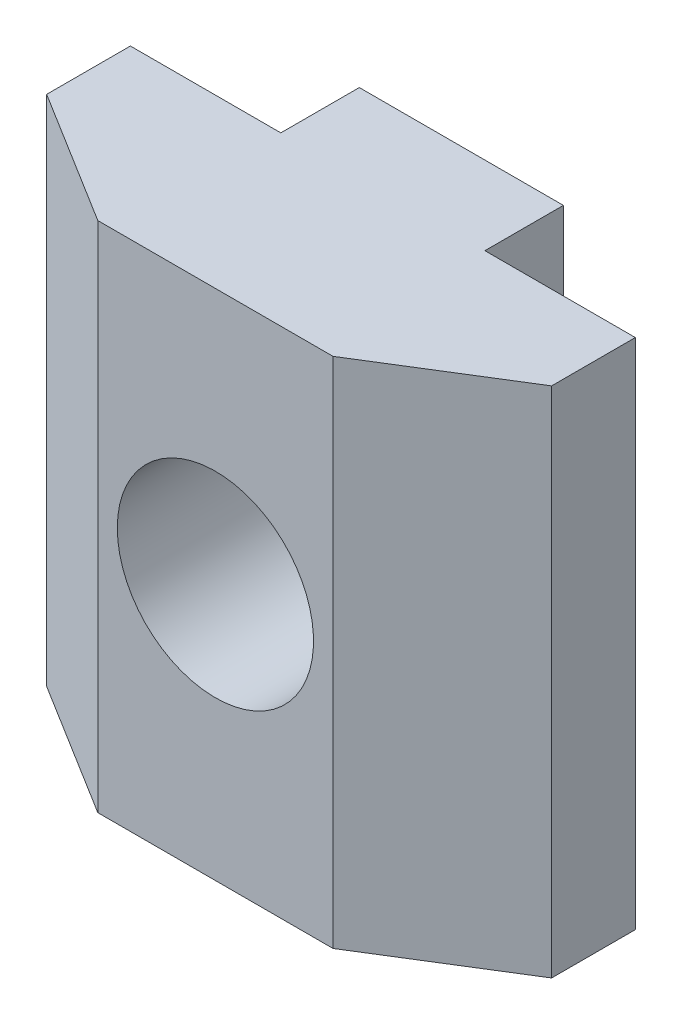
ISO-10303-21;
HEADER;
FILE_DESCRIPTION(('STEP AP214'),'2;1');
FILE_NAME('part.step','',(''),(''),'','','');
FILE_SCHEMA(('AUTOMOTIVE_DESIGN { 1 0 10303 214 1 1 1 1 }'));
ENDSEC;
DATA;
#1=APPLICATION_CONTEXT('core data for automotive mechanical design processes');
#2=APPLICATION_PROTOCOL_DEFINITION('international standard','automotive_design',2000,#1);
#3=PRODUCT_CONTEXT('',#1,'mechanical');
#4=PRODUCT('Part','Part','',(#3));
#5=PRODUCT_RELATED_PRODUCT_CATEGORY('part','',(#4));
#6=PRODUCT_DEFINITION_FORMATION('','',#4);
#7=PRODUCT_DEFINITION_CONTEXT('part definition',#1,'design');
#8=PRODUCT_DEFINITION('design','',#6,#7);
#9=PRODUCT_DEFINITION_SHAPE('','',#8);
#10=(LENGTH_UNIT() NAMED_UNIT(*) SI_UNIT(.MILLI.,.METRE.));
#11=(NAMED_UNIT(*) PLANE_ANGLE_UNIT() SI_UNIT($,.RADIAN.));
#12=(NAMED_UNIT(*) SI_UNIT($,.STERADIAN.) SOLID_ANGLE_UNIT());
#13=UNCERTAINTY_MEASURE_WITH_UNIT(LENGTH_MEASURE(1.E-05),#10,'distance_accuracy_value','');
#14=(GEOMETRIC_REPRESENTATION_CONTEXT(3) GLOBAL_UNCERTAINTY_ASSIGNED_CONTEXT((#13)) GLOBAL_UNIT_ASSIGNED_CONTEXT((#10,
#11,#12)) REPRESENTATION_CONTEXT('',''));
#15=CARTESIAN_POINT('',(0.,0.,0.));
#16=DIRECTION('',(0.,0.,1.));
#17=DIRECTION('',(1.,0.,0.));
#18=AXIS2_PLACEMENT_3D('',#15,#16,#17);
#19=CARTESIAN_POINT('',(-9.65,19.6,-3.2));
#20=DIRECTION('',(0.527403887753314,0.,-0.849614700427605));
#21=DIRECTION('',(-0.849614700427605,0.,-0.527403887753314));
#22=AXIS2_PLACEMENT_3D('',#19,#20,#21);
#23=PLANE('',#22);
#24=DIRECTION('',(0.849614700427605,0.,0.527403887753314));
#25=VECTOR('',#24,1.);
#26=CARTESIAN_POINT('',(-9.65,0.,-3.2));
#27=LINE('',#26,#25);
#28=CARTESIAN_POINT('',(-9.65,0.,-3.2));
#29=VERTEX_POINT('',#28);
#30=CARTESIAN_POINT('',(-4.495,0.,0.));
#31=VERTEX_POINT('',#30);
#32=EDGE_CURVE('E149',#29,#31,#27,.T.);
#33=ORIENTED_EDGE('',*,*,#32,.T.);
#34=DIRECTION('',(0.,-1.,0.));
#35=VECTOR('',#34,1.);
#36=CARTESIAN_POINT('',(-4.495,19.6,0.));
#37=LINE('',#36,#35);
#38=CARTESIAN_POINT('',(-4.495,19.6,0.));
#39=VERTEX_POINT('',#38);
#40=EDGE_CURVE('E11',#39,#31,#37,.T.);
#41=ORIENTED_EDGE('',*,*,#40,.F.);
#42=DIRECTION('',(0.849614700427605,0.,0.527403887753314));
#43=VECTOR('',#42,1.);
#44=CARTESIAN_POINT('',(-9.65,19.6,-3.2));
#45=LINE('',#44,#43);
#46=CARTESIAN_POINT('',(-9.65,19.6,-3.2));
#47=VERTEX_POINT('',#46);
#48=EDGE_CURVE('E169',#47,#39,#45,.T.);
#49=ORIENTED_EDGE('',*,*,#48,.F.);
#50=DIRECTION('',(0.,-1.,0.));
#51=VECTOR('',#50,1.);
#52=CARTESIAN_POINT('',(-9.65,19.6,-3.2));
#53=LINE('',#52,#51);
#54=EDGE_CURVE('E144',#47,#29,#53,.T.);
#55=ORIENTED_EDGE('',*,*,#54,.T.);
#56=EDGE_LOOP('',(#33,#41,#49,#55));
#57=FACE_BOUND('',#56,.T.);
#58=ADVANCED_FACE('F41',(#57),#23,.F.);
#59=CARTESIAN_POINT('',(-4.495,19.6,0.));
#60=DIRECTION('',(0.,0.,-1.));
#61=DIRECTION('',(-1.,0.,0.));
#62=AXIS2_PLACEMENT_3D('',#59,#60,#61);
#63=PLANE('',#62);
#64=CARTESIAN_POINT('',(0.,9.8,0.));
#65=DIRECTION('',(0.,0.,-1.));
#66=DIRECTION('',(-1.,0.,0.));
#67=AXIS2_PLACEMENT_3D('',#64,#65,#66);
#68=CIRCLE('',#67,3.75);
#69=CARTESIAN_POINT('',(-3.75,9.8,0.));
#70=VERTEX_POINT('',#69);
#71=EDGE_CURVE('E153',#70,#70,#68,.T.);
#72=ORIENTED_EDGE('',*,*,#71,.T.);
#73=EDGE_LOOP('',(#72));
#74=FACE_BOUND('',#73,.T.);
#75=DIRECTION('',(1.,0.,0.));
#76=VECTOR('',#75,1.);
#77=CARTESIAN_POINT('',(-4.495,0.,0.));
#78=LINE('',#77,#76);
#79=CARTESIAN_POINT('',(4.495,0.,0.));
#80=VERTEX_POINT('',#79);
#81=EDGE_CURVE('E155',#31,#80,#78,.T.);
#82=ORIENTED_EDGE('',*,*,#81,.T.);
#83=DIRECTION('',(0.,-1.,0.));
#84=VECTOR('',#83,1.);
#85=CARTESIAN_POINT('',(4.495,19.6,0.));
#86=LINE('',#85,#84);
#87=CARTESIAN_POINT('',(4.495,19.6,0.));
#88=VERTEX_POINT('',#87);
#89=EDGE_CURVE('E47',#88,#80,#86,.T.);
#90=ORIENTED_EDGE('',*,*,#89,.F.);
#91=DIRECTION('',(1.,0.,0.));
#92=VECTOR('',#91,1.);
#93=CARTESIAN_POINT('',(-4.495,19.6,0.));
#94=LINE('',#93,#92);
#95=EDGE_CURVE('E106',#39,#88,#94,.T.);
#96=ORIENTED_EDGE('',*,*,#95,.F.);
#97=ORIENTED_EDGE('',*,*,#40,.T.);
#98=EDGE_LOOP('',(#82,#90,#96,#97));
#99=FACE_BOUND('',#98,.T.);
#100=ADVANCED_FACE('F222',(#74,#99),#63,.F.);
#101=CARTESIAN_POINT('',(4.495,19.6,0.));
#102=DIRECTION('',(-0.527403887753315,0.,-0.849614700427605));
#103=DIRECTION('',(-0.849614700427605,0.,0.527403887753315));
#104=AXIS2_PLACEMENT_3D('',#101,#102,#103);
#105=PLANE('',#104);
#106=DIRECTION('',(0.849614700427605,0.,-0.527403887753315));
#107=VECTOR('',#106,1.);
#108=CARTESIAN_POINT('',(4.495,0.,0.));
#109=LINE('',#108,#107);
#110=CARTESIAN_POINT('',(9.65,0.,-3.2));
#111=VERTEX_POINT('',#110);
#112=EDGE_CURVE('E154',#80,#111,#109,.T.);
#113=ORIENTED_EDGE('',*,*,#112,.T.);
#114=DIRECTION('',(0.,-1.,0.));
#115=VECTOR('',#114,1.);
#116=CARTESIAN_POINT('',(9.65,19.6,-3.2));
#117=LINE('',#116,#115);
#118=CARTESIAN_POINT('',(9.65,19.6,-3.2));
#119=VERTEX_POINT('',#118);
#120=EDGE_CURVE('E182',#119,#111,#117,.T.);
#121=ORIENTED_EDGE('',*,*,#120,.F.);
#122=DIRECTION('',(0.849614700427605,0.,-0.527403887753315));
#123=VECTOR('',#122,1.);
#124=CARTESIAN_POINT('',(4.495,19.6,0.));
#125=LINE('',#124,#123);
#126=EDGE_CURVE('E189',#88,#119,#125,.T.);
#127=ORIENTED_EDGE('',*,*,#126,.F.);
#128=ORIENTED_EDGE('',*,*,#89,.T.);
#129=EDGE_LOOP('',(#113,#121,#127,#128));
#130=FACE_BOUND('',#129,.T.);
#131=ADVANCED_FACE('F190',(#130),#105,.F.);
#132=CARTESIAN_POINT('',(9.65,19.6,-3.2));
#133=DIRECTION('',(-1.,0.,0.));
#134=DIRECTION('',(0.,0.,1.));
#135=AXIS2_PLACEMENT_3D('',#132,#133,#134);
#136=PLANE('',#135);
#137=DIRECTION('',(0.,0.,-1.));
#138=VECTOR('',#137,1.);
#139=CARTESIAN_POINT('',(9.65,0.,-3.2));
#140=LINE('',#139,#138);
#141=CARTESIAN_POINT('',(9.65,0.,-6.4));
#142=VERTEX_POINT('',#141);
#143=EDGE_CURVE('E160',#111,#142,#140,.T.);
#144=ORIENTED_EDGE('',*,*,#143,.T.);
#145=DIRECTION('',(0.,-1.,0.));
#146=VECTOR('',#145,1.);
#147=CARTESIAN_POINT('',(9.65,19.6,-6.4));
#148=LINE('',#147,#146);
#149=CARTESIAN_POINT('',(9.65,19.6,-6.4));
#150=VERTEX_POINT('',#149);
#151=EDGE_CURVE('E180',#150,#142,#148,.T.);
#152=ORIENTED_EDGE('',*,*,#151,.F.);
#153=DIRECTION('',(0.,0.,-1.));
#154=VECTOR('',#153,1.);
#155=CARTESIAN_POINT('',(9.65,19.6,-3.2));
#156=LINE('',#155,#154);
#157=EDGE_CURVE('E210',#119,#150,#156,.T.);
#158=ORIENTED_EDGE('',*,*,#157,.F.);
#159=ORIENTED_EDGE('',*,*,#120,.T.);
#160=EDGE_LOOP('',(#144,#152,#158,#159));
#161=FACE_BOUND('',#160,.T.);
#162=ADVANCED_FACE('F196',(#161),#136,.F.);
#163=CARTESIAN_POINT('',(9.65,19.6,-6.4));
#164=DIRECTION('',(0.,0.,1.));
#165=DIRECTION('',(1.,0.,0.));
#166=AXIS2_PLACEMENT_3D('',#163,#164,#165);
#167=PLANE('',#166);
#168=DIRECTION('',(-1.,0.,0.));
#169=VECTOR('',#168,1.);
#170=CARTESIAN_POINT('',(9.65,0.,-6.4));
#171=LINE('',#170,#169);
#172=CARTESIAN_POINT('',(3.9,0.,-6.4));
#173=VERTEX_POINT('',#172);
#174=EDGE_CURVE('E157',#142,#173,#171,.T.);
#175=ORIENTED_EDGE('',*,*,#174,.T.);
#176=DIRECTION('',(0.,-1.,0.));
#177=VECTOR('',#176,1.);
#178=CARTESIAN_POINT('',(3.9,19.6,-6.4));
#179=LINE('',#178,#177);
#180=CARTESIAN_POINT('',(3.9,19.6,-6.4));
#181=VERTEX_POINT('',#180);
#182=EDGE_CURVE('E171',#181,#173,#179,.T.);
#183=ORIENTED_EDGE('',*,*,#182,.F.);
#184=DIRECTION('',(-1.,0.,0.));
#185=VECTOR('',#184,1.);
#186=CARTESIAN_POINT('',(9.65,19.6,-6.4));
#187=LINE('',#186,#185);
#188=EDGE_CURVE('E204',#150,#181,#187,.T.);
#189=ORIENTED_EDGE('',*,*,#188,.F.);
#190=ORIENTED_EDGE('',*,*,#151,.T.);
#191=EDGE_LOOP('',(#175,#183,#189,#190));
#192=FACE_BOUND('',#191,.T.);
#193=ADVANCED_FACE('F205',(#192),#167,.F.);
#194=CARTESIAN_POINT('',(3.9,19.6,-6.4));
#195=DIRECTION('',(-1.,0.,0.));
#196=DIRECTION('',(0.,0.,1.));
#197=AXIS2_PLACEMENT_3D('',#194,#195,#196);
#198=PLANE('',#197);
#199=DIRECTION('',(0.,0.,-1.));
#200=VECTOR('',#199,1.);
#201=CARTESIAN_POINT('',(3.9,0.,-6.4));
#202=LINE('',#201,#200);
#203=CARTESIAN_POINT('',(3.9,0.,-9.4));
#204=VERTEX_POINT('',#203);
#205=EDGE_CURVE('E161',#173,#204,#202,.T.);
#206=ORIENTED_EDGE('',*,*,#205,.T.);
#207=DIRECTION('',(0.,-1.,0.));
#208=VECTOR('',#207,1.);
#209=CARTESIAN_POINT('',(3.9,19.6,-9.4));
#210=LINE('',#209,#208);
#211=CARTESIAN_POINT('',(3.9,19.6,-9.4));
#212=VERTEX_POINT('',#211);
#213=EDGE_CURVE('E175',#212,#204,#210,.T.);
#214=ORIENTED_EDGE('',*,*,#213,.F.);
#215=DIRECTION('',(0.,0.,-1.));
#216=VECTOR('',#215,1.);
#217=CARTESIAN_POINT('',(3.9,19.6,-6.4));
#218=LINE('',#217,#216);
#219=EDGE_CURVE('E206',#181,#212,#218,.T.);
#220=ORIENTED_EDGE('',*,*,#219,.F.);
#221=ORIENTED_EDGE('',*,*,#182,.T.);
#222=EDGE_LOOP('',(#206,#214,#220,#221));
#223=FACE_BOUND('',#222,.T.);
#224=ADVANCED_FACE('F234',(#223),#198,.F.);
#225=CARTESIAN_POINT('',(3.9,19.6,-9.4));
#226=DIRECTION('',(0.,0.,1.));
#227=DIRECTION('',(1.,0.,0.));
#228=AXIS2_PLACEMENT_3D('',#225,#226,#227);
#229=PLANE('',#228);
#230=CARTESIAN_POINT('',(0.,9.8,-9.4));
#231=DIRECTION('',(0.,0.,-1.));
#232=DIRECTION('',(-1.,0.,0.));
#233=AXIS2_PLACEMENT_3D('',#230,#231,#232);
#234=CIRCLE('',#233,3.75);
#235=CARTESIAN_POINT('',(-3.75,9.8,-9.4));
#236=VERTEX_POINT('',#235);
#237=EDGE_CURVE('E214',#236,#236,#234,.T.);
#238=ORIENTED_EDGE('',*,*,#237,.F.);
#239=EDGE_LOOP('',(#238));
#240=FACE_BOUND('',#239,.T.);
#241=DIRECTION('',(-1.,0.,0.));
#242=VECTOR('',#241,1.);
#243=CARTESIAN_POINT('',(3.9,0.,-9.4));
#244=LINE('',#243,#242);
#245=CARTESIAN_POINT('',(-3.9,0.,-9.4));
#246=VERTEX_POINT('',#245);
#247=EDGE_CURVE('E162',#204,#246,#244,.T.);
#248=ORIENTED_EDGE('',*,*,#247,.T.);
#249=DIRECTION('',(0.,-1.,0.));
#250=VECTOR('',#249,1.);
#251=CARTESIAN_POINT('',(-3.9,19.6,-9.4));
#252=LINE('',#251,#250);
#253=CARTESIAN_POINT('',(-3.9,19.6,-9.4));
#254=VERTEX_POINT('',#253);
#255=EDGE_CURVE('E138',#254,#246,#252,.T.);
#256=ORIENTED_EDGE('',*,*,#255,.F.);
#257=DIRECTION('',(-1.,0.,0.));
#258=VECTOR('',#257,1.);
#259=CARTESIAN_POINT('',(3.9,19.6,-9.4));
#260=LINE('',#259,#258);
#261=EDGE_CURVE('E132',#212,#254,#260,.T.);
#262=ORIENTED_EDGE('',*,*,#261,.F.);
#263=ORIENTED_EDGE('',*,*,#213,.T.);
#264=EDGE_LOOP('',(#248,#256,#262,#263));
#265=FACE_BOUND('',#264,.T.);
#266=ADVANCED_FACE('F229',(#240,#265),#229,.F.);
#267=CARTESIAN_POINT('',(-3.9,19.6,-9.4));
#268=DIRECTION('',(1.,0.,0.));
#269=DIRECTION('',(0.,0.,-1.));
#270=AXIS2_PLACEMENT_3D('',#267,#268,#269);
#271=PLANE('',#270);
#272=DIRECTION('',(0.,0.,1.));
#273=VECTOR('',#272,1.);
#274=CARTESIAN_POINT('',(-3.9,0.,-9.4));
#275=LINE('',#274,#273);
#276=CARTESIAN_POINT('',(-3.9,0.,-6.4));
#277=VERTEX_POINT('',#276);
#278=EDGE_CURVE('E136',#246,#277,#275,.T.);
#279=ORIENTED_EDGE('',*,*,#278,.T.);
#280=DIRECTION('',(0.,-1.,0.));
#281=VECTOR('',#280,1.);
#282=CARTESIAN_POINT('',(-3.9,19.6,-6.4));
#283=LINE('',#282,#281);
#284=CARTESIAN_POINT('',(-3.9,19.6,-6.4));
#285=VERTEX_POINT('',#284);
#286=EDGE_CURVE('E137',#285,#277,#283,.T.);
#287=ORIENTED_EDGE('',*,*,#286,.F.);
#288=DIRECTION('',(0.,0.,1.));
#289=VECTOR('',#288,1.);
#290=CARTESIAN_POINT('',(-3.9,19.6,-9.4));
#291=LINE('',#290,#289);
#292=EDGE_CURVE('E123',#254,#285,#291,.T.);
#293=ORIENTED_EDGE('',*,*,#292,.F.);
#294=ORIENTED_EDGE('',*,*,#255,.T.);
#295=EDGE_LOOP('',(#279,#287,#293,#294));
#296=FACE_BOUND('',#295,.T.);
#297=ADVANCED_FACE('F139',(#296),#271,.F.);
#298=CARTESIAN_POINT('',(-3.9,19.6,-6.4));
#299=DIRECTION('',(0.,0.,1.));
#300=DIRECTION('',(1.,0.,0.));
#301=AXIS2_PLACEMENT_3D('',#298,#299,#300);
#302=PLANE('',#301);
#303=DIRECTION('',(-1.,0.,0.));
#304=VECTOR('',#303,1.);
#305=CARTESIAN_POINT('',(-3.9,0.,-6.4));
#306=LINE('',#305,#304);
#307=CARTESIAN_POINT('',(-9.65,0.,-6.4));
#308=VERTEX_POINT('',#307);
#309=EDGE_CURVE('E95',#277,#308,#306,.T.);
#310=ORIENTED_EDGE('',*,*,#309,.T.);
#311=DIRECTION('',(0.,-1.,0.));
#312=VECTOR('',#311,1.);
#313=CARTESIAN_POINT('',(-9.65,19.6,-6.4));
#314=LINE('',#313,#312);
#315=CARTESIAN_POINT('',(-9.65,19.6,-6.4));
#316=VERTEX_POINT('',#315);
#317=EDGE_CURVE('E143',#316,#308,#314,.T.);
#318=ORIENTED_EDGE('',*,*,#317,.F.);
#319=DIRECTION('',(-1.,0.,0.));
#320=VECTOR('',#319,1.);
#321=CARTESIAN_POINT('',(-3.9,19.6,-6.4));
#322=LINE('',#321,#320);
#323=EDGE_CURVE('E129',#285,#316,#322,.T.);
#324=ORIENTED_EDGE('',*,*,#323,.F.);
#325=ORIENTED_EDGE('',*,*,#286,.T.);
#326=EDGE_LOOP('',(#310,#318,#324,#325));
#327=FACE_BOUND('',#326,.T.);
#328=ADVANCED_FACE('F141',(#327),#302,.F.);
#329=CARTESIAN_POINT('',(-9.65,19.6,-6.4));
#330=DIRECTION('',(1.,0.,0.));
#331=DIRECTION('',(0.,0.,-1.));
#332=AXIS2_PLACEMENT_3D('',#329,#330,#331);
#333=PLANE('',#332);
#334=DIRECTION('',(0.,0.,1.));
#335=VECTOR('',#334,1.);
#336=CARTESIAN_POINT('',(-9.65,0.,-6.4));
#337=LINE('',#336,#335);
#338=EDGE_CURVE('E98',#308,#29,#337,.T.);
#339=ORIENTED_EDGE('',*,*,#338,.T.);
#340=ORIENTED_EDGE('',*,*,#54,.F.);
#341=DIRECTION('',(0.,0.,1.));
#342=VECTOR('',#341,1.);
#343=CARTESIAN_POINT('',(-9.65,19.6,-6.4));
#344=LINE('',#343,#342);
#345=EDGE_CURVE('E60',#316,#47,#344,.T.);
#346=ORIENTED_EDGE('',*,*,#345,.F.);
#347=ORIENTED_EDGE('',*,*,#317,.T.);
#348=EDGE_LOOP('',(#339,#340,#346,#347));
#349=FACE_BOUND('',#348,.T.);
#350=ADVANCED_FACE('F239',(#349),#333,.F.);
#351=CARTESIAN_POINT('',(0.,19.6,0.));
#352=DIRECTION('',(0.,1.,0.));
#353=DIRECTION('',(0.,0.,1.));
#354=AXIS2_PLACEMENT_3D('',#351,#352,#353);
#355=PLANE('',#354);
#356=ORIENTED_EDGE('',*,*,#48,.T.);
#357=ORIENTED_EDGE('',*,*,#95,.T.);
#358=ORIENTED_EDGE('',*,*,#126,.T.);
#359=ORIENTED_EDGE('',*,*,#157,.T.);
#360=ORIENTED_EDGE('',*,*,#188,.T.);
#361=ORIENTED_EDGE('',*,*,#219,.T.);
#362=ORIENTED_EDGE('',*,*,#261,.T.);
#363=ORIENTED_EDGE('',*,*,#292,.T.);
#364=ORIENTED_EDGE('',*,*,#323,.T.);
#365=ORIENTED_EDGE('',*,*,#345,.T.);
#366=EDGE_LOOP('',(#356,#357,#358,#359,#360,#361,#362,#363,#364,#365));
#367=FACE_BOUND('',#366,.T.);
#368=ADVANCED_FACE('F130',(#367),#355,.T.);
#369=CARTESIAN_POINT('',(0.,0.,0.));
#370=DIRECTION('',(0.,1.,0.));
#371=DIRECTION('',(0.,0.,1.));
#372=AXIS2_PLACEMENT_3D('',#369,#370,#371);
#373=PLANE('',#372);
#374=ORIENTED_EDGE('',*,*,#32,.F.);
#375=ORIENTED_EDGE('',*,*,#338,.F.);
#376=ORIENTED_EDGE('',*,*,#309,.F.);
#377=ORIENTED_EDGE('',*,*,#278,.F.);
#378=ORIENTED_EDGE('',*,*,#247,.F.);
#379=ORIENTED_EDGE('',*,*,#205,.F.);
#380=ORIENTED_EDGE('',*,*,#174,.F.);
#381=ORIENTED_EDGE('',*,*,#143,.F.);
#382=ORIENTED_EDGE('',*,*,#112,.F.);
#383=ORIENTED_EDGE('',*,*,#81,.F.);
#384=EDGE_LOOP('',(#374,#375,#376,#377,#378,#379,#380,#381,#382,#383));
#385=FACE_BOUND('',#384,.T.);
#386=ADVANCED_FACE('F195',(#385),#373,.F.);
#387=CARTESIAN_POINT('',(0.,9.8,0.));
#388=DIRECTION('',(0.,0.,-1.));
#389=DIRECTION('',(-1.,0.,0.));
#390=AXIS2_PLACEMENT_3D('',#387,#388,#389);
#391=CYLINDRICAL_SURFACE('',#390,3.75);
#392=CARTESIAN_POINT('',(-3.75,9.8,0.));
#393=CARTESIAN_POINT('',(-3.75,9.8,-0.0979166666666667));
#394=CARTESIAN_POINT('',(-3.75,9.8,-0.195833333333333));
#395=CARTESIAN_POINT('',(-3.75,9.8,-0.391666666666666));
#396=CARTESIAN_POINT('',(-3.75,9.8,-0.489583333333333));
#397=CARTESIAN_POINT('',(-3.75,9.8,-0.685416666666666));
#398=CARTESIAN_POINT('',(-3.75,9.8,-0.783333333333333));
#399=CARTESIAN_POINT('',(-3.75,9.8,-0.979166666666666));
#400=CARTESIAN_POINT('',(-3.75,9.8,-1.07708333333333));
#401=CARTESIAN_POINT('',(-3.75,9.8,-1.27291666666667));
#402=CARTESIAN_POINT('',(-3.75,9.8,-1.37083333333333));
#403=CARTESIAN_POINT('',(-3.75,9.8,-1.56666666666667));
#404=CARTESIAN_POINT('',(-3.75,9.8,-1.66458333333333));
#405=CARTESIAN_POINT('',(-3.75,9.8,-1.86041666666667));
#406=CARTESIAN_POINT('',(-3.75,9.8,-1.95833333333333));
#407=CARTESIAN_POINT('',(-3.75,9.8,-2.15416666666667));
#408=CARTESIAN_POINT('',(-3.75,9.8,-2.25208333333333));
#409=CARTESIAN_POINT('',(-3.75,9.8,-2.44791666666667));
#410=CARTESIAN_POINT('',(-3.75,9.8,-2.54583333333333));
#411=CARTESIAN_POINT('',(-3.75,9.8,-2.74166666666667));
#412=CARTESIAN_POINT('',(-3.75,9.8,-2.83958333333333));
#413=CARTESIAN_POINT('',(-3.75,9.8,-3.03541666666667));
#414=CARTESIAN_POINT('',(-3.75,9.8,-3.13333333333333));
#415=CARTESIAN_POINT('',(-3.75,9.8,-3.32916666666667));
#416=CARTESIAN_POINT('',(-3.75,9.8,-3.42708333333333));
#417=CARTESIAN_POINT('',(-3.75,9.8,-3.62291666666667));
#418=CARTESIAN_POINT('',(-3.75,9.8,-3.72083333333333));
#419=CARTESIAN_POINT('',(-3.75,9.8,-3.91666666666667));
#420=CARTESIAN_POINT('',(-3.75,9.8,-4.01458333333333));
#421=CARTESIAN_POINT('',(-3.75,9.8,-4.21041666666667));
#422=CARTESIAN_POINT('',(-3.75,9.8,-4.30833333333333));
#423=CARTESIAN_POINT('',(-3.75,9.8,-4.50416666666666));
#424=CARTESIAN_POINT('',(-3.75,9.8,-4.60208333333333));
#425=CARTESIAN_POINT('',(-3.75,9.8,-4.79791666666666));
#426=CARTESIAN_POINT('',(-3.75,9.8,-4.89583333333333));
#427=CARTESIAN_POINT('',(-3.75,9.8,-5.09166666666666));
#428=CARTESIAN_POINT('',(-3.75,9.8,-5.18958333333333));
#429=CARTESIAN_POINT('',(-3.75,9.8,-5.38541666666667));
#430=CARTESIAN_POINT('',(-3.75,9.8,-5.48333333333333));
#431=CARTESIAN_POINT('',(-3.75,9.8,-5.67916666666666));
#432=CARTESIAN_POINT('',(-3.75,9.8,-5.77708333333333));
#433=CARTESIAN_POINT('',(-3.75,9.8,-5.97291666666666));
#434=CARTESIAN_POINT('',(-3.75,9.8,-6.07083333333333));
#435=CARTESIAN_POINT('',(-3.75,9.8,-6.26666666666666));
#436=CARTESIAN_POINT('',(-3.75,9.8,-6.36458333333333));
#437=CARTESIAN_POINT('',(-3.75,9.8,-6.56041666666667));
#438=CARTESIAN_POINT('',(-3.75,9.8,-6.65833333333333));
#439=CARTESIAN_POINT('',(-3.75,9.8,-6.85416666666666));
#440=CARTESIAN_POINT('',(-3.75,9.8,-6.95208333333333));
#441=CARTESIAN_POINT('',(-3.75,9.8,-7.14791666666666));
#442=CARTESIAN_POINT('',(-3.75,9.8,-7.24583333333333));
#443=CARTESIAN_POINT('',(-3.75,9.8,-7.44166666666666));
#444=CARTESIAN_POINT('',(-3.75,9.8,-7.53958333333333));
#445=CARTESIAN_POINT('',(-3.75,9.8,-7.73541666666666));
#446=CARTESIAN_POINT('',(-3.75,9.8,-7.83333333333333));
#447=CARTESIAN_POINT('',(-3.75,9.8,-8.02916666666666));
#448=CARTESIAN_POINT('',(-3.75,9.8,-8.12708333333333));
#449=CARTESIAN_POINT('',(-3.75,9.8,-8.32291666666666));
#450=CARTESIAN_POINT('',(-3.75,9.8,-8.42083333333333));
#451=CARTESIAN_POINT('',(-3.75,9.8,-8.61666666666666));
#452=CARTESIAN_POINT('',(-3.75,9.8,-8.71458333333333));
#453=CARTESIAN_POINT('',(-3.75,9.8,-8.91041666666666));
#454=CARTESIAN_POINT('',(-3.75,9.8,-9.00833333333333));
#455=CARTESIAN_POINT('',(-3.75,9.8,-9.20416666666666));
#456=CARTESIAN_POINT('',(-3.75,9.8,-9.30208333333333));
#457=CARTESIAN_POINT('',(-3.75,9.8,-9.4));
#458=B_SPLINE_CURVE_WITH_KNOTS('',3,(#392,#393,#394,#395,#396,#397,#398,#399,#400,#401,#402,
#403,#404,#405,#406,#407,#408,#409,#410,#411,#412,#413,#414,#415,#416,#417,#418,#419,#420,#421,
#422,#423,#424,#425,#426,#427,#428,#429,#430,#431,#432,#433,#434,#435,#436,#437,#438,#439,#440,
#441,#442,#443,#444,#445,#446,#447,#448,#449,#450,#451,#452,#453,#454,#455,#456,#457),
.UNSPECIFIED.,.F.,.F.,(4,2,2,2,2,2,2,2,2,2,2,2,2,2,2,2,2,2,2,2,2,2,2,2,2,2,2,2,2,2,2,2,4),(0.,
0.29375,0.5875,0.88125,1.175,1.46875,1.7625,2.05625,2.35,2.64375,2.9375,3.23125,3.525,3.81875,
4.1125,4.40625,4.7,4.99375,5.2875,5.58125,5.875,6.16875,6.4625,6.75625,7.05,7.34375,7.6375,
7.93125,8.225,8.51875,8.8125,9.10625,9.4),.UNSPECIFIED.);
#459=EDGE_CURVE('BSEAM224',#70,#236,#458,.T.);
#460=ORIENTED_EDGE('',*,*,#71,.F.);
#461=ORIENTED_EDGE('',*,*,#237,.T.);
#462=ORIENTED_EDGE('',*,*,#459,.T.);
#463=ORIENTED_EDGE('',*,*,#459,.F.);
#464=EDGE_LOOP('',(#460,#462,#461,#463));
#465=FACE_BOUND('',#464,.T.);
#466=ADVANCED_FACE('F224',(#465),#391,.F.);
#467=CLOSED_SHELL('',(#58,#100,#131,#162,#193,#224,#266,#297,#328,#350,#368,#386,#466));
#468=MANIFOLD_SOLID_BREP('B2',#467);
#469=ADVANCED_BREP_SHAPE_REPRESENTATION('',(#18,#468),#14);
#470=SHAPE_DEFINITION_REPRESENTATION(#9,#469);
ENDSEC;
END-ISO-10303-21;
